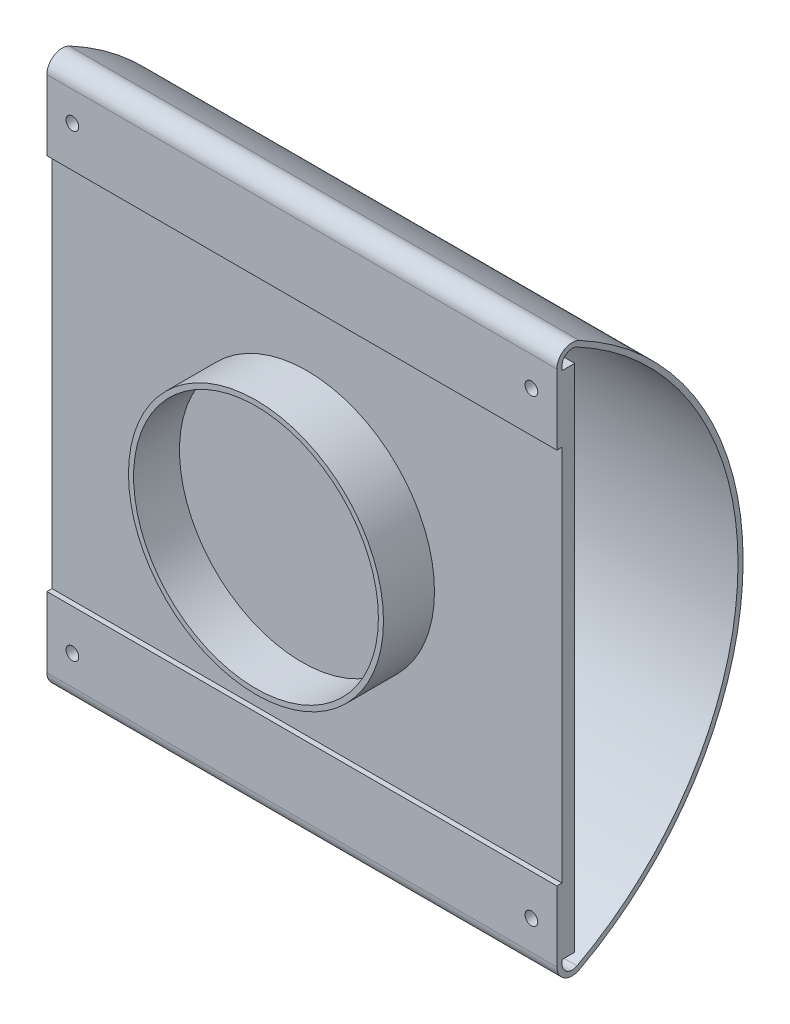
ISO-10303-21;
HEADER;
FILE_DESCRIPTION(('STEP AP214'),'2;1');
FILE_NAME('part.step','',(''),(''),'','','');
FILE_SCHEMA(('AUTOMOTIVE_DESIGN { 1 0 10303 214 1 1 1 1 }'));
ENDSEC;
DATA;
#1=APPLICATION_CONTEXT('core data for automotive mechanical design processes');
#2=APPLICATION_PROTOCOL_DEFINITION('international standard','automotive_design',2000,#1);
#3=PRODUCT_CONTEXT('',#1,'mechanical');
#4=PRODUCT('Part','Part','',(#3));
#5=PRODUCT_RELATED_PRODUCT_CATEGORY('part','',(#4));
#6=PRODUCT_DEFINITION_FORMATION('','',#4);
#7=PRODUCT_DEFINITION_CONTEXT('part definition',#1,'design');
#8=PRODUCT_DEFINITION('design','',#6,#7);
#9=PRODUCT_DEFINITION_SHAPE('','',#8);
#10=(LENGTH_UNIT() NAMED_UNIT(*) SI_UNIT(.MILLI.,.METRE.));
#11=(NAMED_UNIT(*) PLANE_ANGLE_UNIT() SI_UNIT($,.RADIAN.));
#12=(NAMED_UNIT(*) SI_UNIT($,.STERADIAN.) SOLID_ANGLE_UNIT());
#13=UNCERTAINTY_MEASURE_WITH_UNIT(LENGTH_MEASURE(1.E-05),#10,'distance_accuracy_value','');
#14=(GEOMETRIC_REPRESENTATION_CONTEXT(3) GLOBAL_UNCERTAINTY_ASSIGNED_CONTEXT((#13)) GLOBAL_UNIT_ASSIGNED_CONTEXT((#10,
#11,#12)) REPRESENTATION_CONTEXT('',''));
#15=CARTESIAN_POINT('',(0.,0.,0.));
#16=DIRECTION('',(0.,0.,1.));
#17=DIRECTION('',(1.,0.,0.));
#18=AXIS2_PLACEMENT_3D('',#15,#16,#17);
#19=CARTESIAN_POINT('',(-100.,-100.,5.));
#20=DIRECTION('',(0.,0.,-1.));
#21=DIRECTION('',(-1.,0.,0.));
#22=AXIS2_PLACEMENT_3D('',#19,#20,#21);
#23=PLANE('',#22);
#24=DIRECTION('',(0.,1.,0.));
#25=VECTOR('',#24,1.);
#26=CARTESIAN_POINT('',(-100.,-100.,5.));
#27=LINE('',#26,#25);
#28=CARTESIAN_POINT('',(-100.,-101.549200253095,5.00000000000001));
#29=VERTEX_POINT('',#28);
#30=CARTESIAN_POINT('',(-100.,-100.,5.));
#31=VERTEX_POINT('',#30);
#32=EDGE_CURVE('E213',#29,#31,#27,.T.);
#33=ORIENTED_EDGE('',*,*,#32,.T.);
#34=DIRECTION('',(1.,0.,0.));
#35=VECTOR('',#34,1.);
#36=CARTESIAN_POINT('',(-100.,-100.,5.));
#37=LINE('',#36,#35);
#38=CARTESIAN_POINT('',(100.,-100.,5.));
#39=VERTEX_POINT('',#38);
#40=EDGE_CURVE('E384',#31,#39,#37,.T.);
#41=ORIENTED_EDGE('',*,*,#40,.T.);
#42=DIRECTION('',(0.,1.,0.));
#43=VECTOR('',#42,1.);
#44=CARTESIAN_POINT('',(100.,-100.,5.));
#45=LINE('',#44,#43);
#46=CARTESIAN_POINT('',(100.,-101.549200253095,5.00000000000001));
#47=VERTEX_POINT('',#46);
#48=EDGE_CURVE('E310',#47,#39,#45,.T.);
#49=ORIENTED_EDGE('',*,*,#48,.F.);
#50=DIRECTION('',(1.,0.,0.));
#51=VECTOR('',#50,1.);
#52=CARTESIAN_POINT('',(-100.,-101.549200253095,5.00000000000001));
#53=LINE('',#52,#51);
#54=EDGE_CURVE('E259',#29,#47,#53,.T.);
#55=ORIENTED_EDGE('',*,*,#54,.F.);
#56=EDGE_LOOP('',(#33,#41,#49,#55));
#57=FACE_BOUND('',#56,.T.);
#58=ADVANCED_FACE('F50',(#57),#23,.T.);
#59=CARTESIAN_POINT('',(-100.,100.,5.));
#60=DIRECTION('',(0.,0.,-1.));
#61=DIRECTION('',(-1.,0.,0.));
#62=AXIS2_PLACEMENT_3D('',#59,#60,#61);
#63=PLANE('',#62);
#64=DIRECTION('',(0.,1.,0.));
#65=VECTOR('',#64,1.);
#66=CARTESIAN_POINT('',(100.,74.,5.));
#67=LINE('',#66,#65);
#68=CARTESIAN_POINT('',(100.,100.,5.));
#69=VERTEX_POINT('',#68);
#70=CARTESIAN_POINT('',(100.,101.549200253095,5.));
#71=VERTEX_POINT('',#70);
#72=EDGE_CURVE('E181',#69,#71,#67,.T.);
#73=ORIENTED_EDGE('',*,*,#72,.F.);
#74=DIRECTION('',(-1.,0.,0.));
#75=VECTOR('',#74,1.);
#76=CARTESIAN_POINT('',(-100.,100.,5.));
#77=LINE('',#76,#75);
#78=CARTESIAN_POINT('',(-100.,100.,5.));
#79=VERTEX_POINT('',#78);
#80=EDGE_CURVE('E167',#69,#79,#77,.T.);
#81=ORIENTED_EDGE('',*,*,#80,.T.);
#82=DIRECTION('',(0.,1.,0.));
#83=VECTOR('',#82,1.);
#84=CARTESIAN_POINT('',(-100.,74.,5.));
#85=LINE('',#84,#83);
#86=CARTESIAN_POINT('',(-100.,101.549200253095,5.));
#87=VERTEX_POINT('',#86);
#88=EDGE_CURVE('E179',#79,#87,#85,.T.);
#89=ORIENTED_EDGE('',*,*,#88,.T.);
#90=DIRECTION('',(1.,0.,0.));
#91=VECTOR('',#90,1.);
#92=CARTESIAN_POINT('',(-100.,101.549200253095,5.));
#93=LINE('',#92,#91);
#94=EDGE_CURVE('E267',#87,#71,#93,.T.);
#95=ORIENTED_EDGE('',*,*,#94,.T.);
#96=EDGE_LOOP('',(#73,#81,#89,#95));
#97=FACE_BOUND('',#96,.T.);
#98=ADVANCED_FACE('F177',(#97),#63,.T.);
#99=CARTESIAN_POINT('',(-100.,74.,7.));
#100=DIRECTION('',(0.,-1.,0.));
#101=DIRECTION('',(0.,0.,-1.));
#102=AXIS2_PLACEMENT_3D('',#99,#100,#101);
#103=PLANE('',#102);
#104=DIRECTION('',(1.,0.,0.));
#105=VECTOR('',#104,1.);
#106=CARTESIAN_POINT('',(-100.,74.,5.));
#107=LINE('',#106,#105);
#108=CARTESIAN_POINT('',(-100.,74.,5.));
#109=VERTEX_POINT('',#108);
#110=CARTESIAN_POINT('',(100.,74.,5.));
#111=VERTEX_POINT('',#110);
#112=EDGE_CURVE('E237',#109,#111,#107,.T.);
#113=ORIENTED_EDGE('',*,*,#112,.T.);
#114=DIRECTION('',(0.,0.,-1.));
#115=VECTOR('',#114,1.);
#116=CARTESIAN_POINT('',(100.,74.,7.));
#117=LINE('',#116,#115);
#118=CARTESIAN_POINT('',(100.,74.,7.));
#119=VERTEX_POINT('',#118);
#120=EDGE_CURVE('E275',#119,#111,#117,.T.);
#121=ORIENTED_EDGE('',*,*,#120,.F.);
#122=DIRECTION('',(1.,0.,0.));
#123=VECTOR('',#122,1.);
#124=CARTESIAN_POINT('',(-100.,74.,7.));
#125=LINE('',#124,#123);
#126=CARTESIAN_POINT('',(-100.,74.,7.));
#127=VERTEX_POINT('',#126);
#128=EDGE_CURVE('E59',#127,#119,#125,.T.);
#129=ORIENTED_EDGE('',*,*,#128,.F.);
#130=DIRECTION('',(0.,0.,-1.));
#131=VECTOR('',#130,1.);
#132=CARTESIAN_POINT('',(-100.,74.,7.));
#133=LINE('',#132,#131);
#134=EDGE_CURVE('E193',#127,#109,#133,.T.);
#135=ORIENTED_EDGE('',*,*,#134,.T.);
#136=EDGE_LOOP('',(#113,#121,#129,#135));
#137=FACE_BOUND('',#136,.T.);
#138=ADVANCED_FACE('F52',(#137),#103,.T.);
#139=CARTESIAN_POINT('',(-100.,74.,7.));
#140=DIRECTION('',(0.,0.,1.));
#141=DIRECTION('',(1.,0.,0.));
#142=AXIS2_PLACEMENT_3D('',#139,#140,#141);
#143=PLANE('',#142);
#144=CARTESIAN_POINT('',(90.,90.,7.));
#145=DIRECTION('',(0.,0.,1.));
#146=DIRECTION('',(-1.,0.,0.));
#147=AXIS2_PLACEMENT_3D('',#144,#145,#146);
#148=CIRCLE('',#147,2.50000000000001);
#149=CARTESIAN_POINT('',(87.5,90.,7.));
#150=VERTEX_POINT('',#149);
#151=EDGE_CURVE('E398',#150,#150,#148,.T.);
#152=ORIENTED_EDGE('',*,*,#151,.F.);
#153=EDGE_LOOP('',(#152));
#154=FACE_BOUND('',#153,.T.);
#155=CARTESIAN_POINT('',(-90.,89.9999999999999,7.));
#156=DIRECTION('',(0.,0.,1.));
#157=DIRECTION('',(1.,0.,0.));
#158=AXIS2_PLACEMENT_3D('',#155,#156,#157);
#159=CIRCLE('',#158,2.50000000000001);
#160=CARTESIAN_POINT('',(-87.5,89.9999999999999,7.));
#161=VERTEX_POINT('',#160);
#162=EDGE_CURVE('E347',#161,#161,#159,.T.);
#163=ORIENTED_EDGE('',*,*,#162,.F.);
#164=EDGE_LOOP('',(#163));
#165=FACE_BOUND('',#164,.T.);
#166=ORIENTED_EDGE('',*,*,#128,.T.);
#167=DIRECTION('',(0.,-1.,0.));
#168=VECTOR('',#167,1.);
#169=CARTESIAN_POINT('',(100.,100.,7.));
#170=LINE('',#169,#168);
#171=CARTESIAN_POINT('',(100.,101.549200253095,7.00000000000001));
#172=VERTEX_POINT('',#171);
#173=EDGE_CURVE('E202',#172,#119,#170,.T.);
#174=ORIENTED_EDGE('',*,*,#173,.F.);
#175=DIRECTION('',(1.,0.,0.));
#176=VECTOR('',#175,1.);
#177=CARTESIAN_POINT('',(-100.,101.549200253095,7.00000000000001));
#178=LINE('',#177,#176);
#179=CARTESIAN_POINT('',(-100.,101.549200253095,7.00000000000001));
#180=VERTEX_POINT('',#179);
#181=EDGE_CURVE('E240',#180,#172,#178,.T.);
#182=ORIENTED_EDGE('',*,*,#181,.F.);
#183=DIRECTION('',(0.,-1.,0.));
#184=VECTOR('',#183,1.);
#185=CARTESIAN_POINT('',(-100.,100.,7.));
#186=LINE('',#185,#184);
#187=EDGE_CURVE('E74',#180,#127,#186,.T.);
#188=ORIENTED_EDGE('',*,*,#187,.T.);
#189=EDGE_LOOP('',(#166,#174,#182,#188));
#190=FACE_BOUND('',#189,.T.);
#191=ADVANCED_FACE('F408',(#154,#165,#190),#143,.T.);
#192=CARTESIAN_POINT('',(-100.,101.549200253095,1.));
#193=DIRECTION('',(1.,0.,0.));
#194=DIRECTION('',(0.,0.,-1.));
#195=AXIS2_PLACEMENT_3D('',#192,#193,#194);
#196=CYLINDRICAL_SURFACE('',#195,6.00000000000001);
#197=ORIENTED_EDGE('',*,*,#181,.T.);
#198=CARTESIAN_POINT('',(100.,101.549200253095,1.));
#199=DIRECTION('',(1.,0.,0.));
#200=DIRECTION('',(0.,0.,1.));
#201=AXIS2_PLACEMENT_3D('',#198,#199,#200);
#202=CIRCLE('',#201,6.00000000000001);
#203=CARTESIAN_POINT('',(100.,106.847419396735,-1.81582561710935));
#204=VERTEX_POINT('',#203);
#205=EDGE_CURVE('E329',#204,#172,#202,.T.);
#206=ORIENTED_EDGE('',*,*,#205,.F.);
#207=DIRECTION('',(1.,0.,0.));
#208=VECTOR('',#207,1.);
#209=CARTESIAN_POINT('',(-100.,106.847419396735,-1.81582561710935));
#210=LINE('',#209,#208);
#211=CARTESIAN_POINT('',(-100.,106.847419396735,-1.81582561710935));
#212=VERTEX_POINT('',#211);
#213=EDGE_CURVE('E243',#212,#204,#210,.T.);
#214=ORIENTED_EDGE('',*,*,#213,.F.);
#215=CARTESIAN_POINT('',(-100.,101.549200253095,1.));
#216=DIRECTION('',(1.,0.,0.));
#217=DIRECTION('',(0.,0.,1.));
#218=AXIS2_PLACEMENT_3D('',#215,#216,#217);
#219=CIRCLE('',#218,6.00000000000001);
#220=EDGE_CURVE('E231',#212,#180,#219,.T.);
#221=ORIENTED_EDGE('',*,*,#220,.T.);
#222=EDGE_LOOP('',(#197,#206,#214,#221));
#223=FACE_BOUND('',#222,.T.);
#224=ADVANCED_FACE('F411',(#223),#196,.T.);
#225=CARTESIAN_POINT('',(-100.,0.,54.9699909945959));
#226=DIRECTION('',(1.,0.,0.));
#227=DIRECTION('',(0.,0.,-1.));
#228=AXIS2_PLACEMENT_3D('',#225,#226,#227);
#229=CYLINDRICAL_SURFACE('',#228,121.);
#230=ORIENTED_EDGE('',*,*,#213,.T.);
#231=CARTESIAN_POINT('',(100.,0.,54.9699909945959));
#232=DIRECTION('',(1.,0.,0.));
#233=DIRECTION('',(0.,0.,1.));
#234=AXIS2_PLACEMENT_3D('',#231,#232,#233);
#235=CIRCLE('',#234,121.);
#236=CARTESIAN_POINT('',(100.,-106.847419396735,-1.81582561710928));
#237=VERTEX_POINT('',#236);
#238=EDGE_CURVE('E325',#237,#204,#235,.T.);
#239=ORIENTED_EDGE('',*,*,#238,.F.);
#240=DIRECTION('',(1.,0.,0.));
#241=VECTOR('',#240,1.);
#242=CARTESIAN_POINT('',(-100.,-106.847419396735,-1.81582561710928));
#243=LINE('',#242,#241);
#244=CARTESIAN_POINT('',(-100.,-106.847419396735,-1.81582561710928));
#245=VERTEX_POINT('',#244);
#246=EDGE_CURVE('E246',#245,#237,#243,.T.);
#247=ORIENTED_EDGE('',*,*,#246,.F.);
#248=CARTESIAN_POINT('',(-100.,0.,54.9699909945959));
#249=DIRECTION('',(1.,0.,0.));
#250=DIRECTION('',(0.,0.,1.));
#251=AXIS2_PLACEMENT_3D('',#248,#249,#250);
#252=CIRCLE('',#251,121.);
#253=EDGE_CURVE('E228',#245,#212,#252,.T.);
#254=ORIENTED_EDGE('',*,*,#253,.T.);
#255=EDGE_LOOP('',(#230,#239,#247,#254));
#256=FACE_BOUND('',#255,.T.);
#257=ADVANCED_FACE('F432',(#256),#229,.T.);
#258=CARTESIAN_POINT('',(-100.,-101.549200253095,1.));
#259=DIRECTION('',(1.,0.,0.));
#260=DIRECTION('',(0.,0.,-1.));
#261=AXIS2_PLACEMENT_3D('',#258,#259,#260);
#262=CYLINDRICAL_SURFACE('',#261,6.00000000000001);
#263=ORIENTED_EDGE('',*,*,#246,.T.);
#264=CARTESIAN_POINT('',(100.,-101.549200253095,1.));
#265=DIRECTION('',(1.,0.,0.));
#266=DIRECTION('',(0.,0.,1.));
#267=AXIS2_PLACEMENT_3D('',#264,#265,#266);
#268=CIRCLE('',#267,6.00000000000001);
#269=CARTESIAN_POINT('',(100.,-101.549200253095,7.00000000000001));
#270=VERTEX_POINT('',#269);
#271=EDGE_CURVE('E321',#270,#237,#268,.T.);
#272=ORIENTED_EDGE('',*,*,#271,.F.);
#273=DIRECTION('',(1.,0.,0.));
#274=VECTOR('',#273,1.);
#275=CARTESIAN_POINT('',(-100.,-101.549200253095,7.00000000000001));
#276=LINE('',#275,#274);
#277=CARTESIAN_POINT('',(-100.,-101.549200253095,7.00000000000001));
#278=VERTEX_POINT('',#277);
#279=EDGE_CURVE('E249',#278,#270,#276,.T.);
#280=ORIENTED_EDGE('',*,*,#279,.F.);
#281=CARTESIAN_POINT('',(-100.,-101.549200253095,1.));
#282=DIRECTION('',(1.,0.,0.));
#283=DIRECTION('',(0.,0.,1.));
#284=AXIS2_PLACEMENT_3D('',#281,#282,#283);
#285=CIRCLE('',#284,6.00000000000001);
#286=EDGE_CURVE('E224',#278,#245,#285,.T.);
#287=ORIENTED_EDGE('',*,*,#286,.T.);
#288=EDGE_LOOP('',(#263,#272,#280,#287));
#289=FACE_BOUND('',#288,.T.);
#290=ADVANCED_FACE('F429',(#289),#262,.T.);
#291=CARTESIAN_POINT('',(-100.,-100.,7.));
#292=DIRECTION('',(0.,0.,1.));
#293=DIRECTION('',(0.,-1.,0.));
#294=AXIS2_PLACEMENT_3D('',#291,#292,#293);
#295=PLANE('',#294);
#296=CARTESIAN_POINT('',(-90.,-89.9999999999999,7.));
#297=DIRECTION('',(0.,0.,1.));
#298=DIRECTION('',(-1.,0.,0.));
#299=AXIS2_PLACEMENT_3D('',#296,#297,#298);
#300=CIRCLE('',#299,2.50000000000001);
#301=CARTESIAN_POINT('',(-92.5,-89.9999999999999,7.));
#302=VERTEX_POINT('',#301);
#303=EDGE_CURVE('E295',#302,#302,#300,.T.);
#304=ORIENTED_EDGE('',*,*,#303,.F.);
#305=EDGE_LOOP('',(#304));
#306=FACE_BOUND('',#305,.T.);
#307=CARTESIAN_POINT('',(90.,-90.,7.));
#308=DIRECTION('',(0.,0.,1.));
#309=DIRECTION('',(1.,0.,0.));
#310=AXIS2_PLACEMENT_3D('',#307,#308,#309);
#311=CIRCLE('',#310,2.50000000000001);
#312=CARTESIAN_POINT('',(92.5,-90.,7.));
#313=VERTEX_POINT('',#312);
#314=EDGE_CURVE('E286',#313,#313,#311,.T.);
#315=ORIENTED_EDGE('',*,*,#314,.F.);
#316=EDGE_LOOP('',(#315));
#317=FACE_BOUND('',#316,.T.);
#318=ORIENTED_EDGE('',*,*,#279,.T.);
#319=DIRECTION('',(0.,-1.,0.));
#320=VECTOR('',#319,1.);
#321=CARTESIAN_POINT('',(100.,-100.,7.));
#322=LINE('',#321,#320);
#323=CARTESIAN_POINT('',(100.,-74.,7.));
#324=VERTEX_POINT('',#323);
#325=EDGE_CURVE('E317',#324,#270,#322,.T.);
#326=ORIENTED_EDGE('',*,*,#325,.F.);
#327=DIRECTION('',(1.,0.,0.));
#328=VECTOR('',#327,1.);
#329=CARTESIAN_POINT('',(-100.,-74.,7.));
#330=LINE('',#329,#328);
#331=CARTESIAN_POINT('',(-100.,-74.,7.));
#332=VERTEX_POINT('',#331);
#333=EDGE_CURVE('E252',#332,#324,#330,.T.);
#334=ORIENTED_EDGE('',*,*,#333,.F.);
#335=DIRECTION('',(0.,-1.,0.));
#336=VECTOR('',#335,1.);
#337=CARTESIAN_POINT('',(-100.,-100.,7.));
#338=LINE('',#337,#336);
#339=EDGE_CURVE('E221',#332,#278,#338,.T.);
#340=ORIENTED_EDGE('',*,*,#339,.T.);
#341=EDGE_LOOP('',(#318,#326,#334,#340));
#342=FACE_BOUND('',#341,.T.);
#343=ADVANCED_FACE('F425',(#306,#317,#342),#295,.T.);
#344=CARTESIAN_POINT('',(-100.,-74.,7.));
#345=DIRECTION('',(0.,1.,0.));
#346=DIRECTION('',(0.,0.,1.));
#347=AXIS2_PLACEMENT_3D('',#344,#345,#346);
#348=PLANE('',#347);
#349=ORIENTED_EDGE('',*,*,#333,.T.);
#350=DIRECTION('',(0.,0.,1.));
#351=VECTOR('',#350,1.);
#352=CARTESIAN_POINT('',(100.,-74.,7.));
#353=LINE('',#352,#351);
#354=CARTESIAN_POINT('',(100.,-74.,5.));
#355=VERTEX_POINT('',#354);
#356=EDGE_CURVE('E314',#355,#324,#353,.T.);
#357=ORIENTED_EDGE('',*,*,#356,.F.);
#358=DIRECTION('',(1.,0.,0.));
#359=VECTOR('',#358,1.);
#360=CARTESIAN_POINT('',(-100.,-74.,5.));
#361=LINE('',#360,#359);
#362=CARTESIAN_POINT('',(-100.,-74.,5.));
#363=VERTEX_POINT('',#362);
#364=EDGE_CURVE('E255',#363,#355,#361,.T.);
#365=ORIENTED_EDGE('',*,*,#364,.F.);
#366=DIRECTION('',(0.,0.,1.));
#367=VECTOR('',#366,1.);
#368=CARTESIAN_POINT('',(-100.,-74.,7.));
#369=LINE('',#368,#367);
#370=EDGE_CURVE('E217',#363,#332,#369,.T.);
#371=ORIENTED_EDGE('',*,*,#370,.T.);
#372=EDGE_LOOP('',(#349,#357,#365,#371));
#373=FACE_BOUND('',#372,.T.);
#374=ADVANCED_FACE('F421',(#373),#348,.T.);
#375=CARTESIAN_POINT('',(-100.,-101.549200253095,1.));
#376=DIRECTION('',(1.,0.,0.));
#377=DIRECTION('',(0.,0.,-1.));
#378=AXIS2_PLACEMENT_3D('',#375,#376,#377);
#379=CYLINDRICAL_SURFACE('',#378,4.00000000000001);
#380=ORIENTED_EDGE('',*,*,#54,.T.);
#381=CARTESIAN_POINT('',(100.,-101.549200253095,1.));
#382=DIRECTION('',(-1.,0.,0.));
#383=DIRECTION('',(0.,0.,1.));
#384=AXIS2_PLACEMENT_3D('',#381,#382,#383);
#385=CIRCLE('',#384,4.00000000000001);
#386=CARTESIAN_POINT('',(100.,-105.081346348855,-0.877217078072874));
#387=VERTEX_POINT('',#386);
#388=EDGE_CURVE('E306',#387,#47,#385,.T.);
#389=ORIENTED_EDGE('',*,*,#388,.F.);
#390=DIRECTION('',(1.,0.,0.));
#391=VECTOR('',#390,1.);
#392=CARTESIAN_POINT('',(-100.,-105.081346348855,-0.877217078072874));
#393=LINE('',#392,#391);
#394=CARTESIAN_POINT('',(-100.,-105.081346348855,-0.877217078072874));
#395=VERTEX_POINT('',#394);
#396=EDGE_CURVE('E261',#395,#387,#393,.T.);
#397=ORIENTED_EDGE('',*,*,#396,.F.);
#398=CARTESIAN_POINT('',(-100.,-101.549200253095,1.));
#399=DIRECTION('',(-1.,0.,0.));
#400=DIRECTION('',(0.,0.,1.));
#401=AXIS2_PLACEMENT_3D('',#398,#399,#400);
#402=CIRCLE('',#401,4.00000000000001);
#403=EDGE_CURVE('E209',#395,#29,#402,.T.);
#404=ORIENTED_EDGE('',*,*,#403,.T.);
#405=EDGE_LOOP('',(#380,#389,#397,#404));
#406=FACE_BOUND('',#405,.T.);
#407=ADVANCED_FACE('F451',(#406),#379,.F.);
#408=CARTESIAN_POINT('',(-100.,0.,54.9699909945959));
#409=DIRECTION('',(1.,0.,0.));
#410=DIRECTION('',(0.,0.,-1.));
#411=AXIS2_PLACEMENT_3D('',#408,#409,#410);
#412=CYLINDRICAL_SURFACE('',#411,119.);
#413=ORIENTED_EDGE('',*,*,#396,.T.);
#414=CARTESIAN_POINT('',(100.,0.,54.9699909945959));
#415=DIRECTION('',(-1.,0.,0.));
#416=DIRECTION('',(0.,0.,1.));
#417=AXIS2_PLACEMENT_3D('',#414,#415,#416);
#418=CIRCLE('',#417,119.);
#419=CARTESIAN_POINT('',(100.,105.081346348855,-0.877217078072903));
#420=VERTEX_POINT('',#419);
#421=EDGE_CURVE('E302',#420,#387,#418,.T.);
#422=ORIENTED_EDGE('',*,*,#421,.F.);
#423=DIRECTION('',(1.,0.,0.));
#424=VECTOR('',#423,1.);
#425=CARTESIAN_POINT('',(-100.,105.081346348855,-0.877217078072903));
#426=LINE('',#425,#424);
#427=CARTESIAN_POINT('',(-100.,105.081346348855,-0.877217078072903));
#428=VERTEX_POINT('',#427);
#429=EDGE_CURVE('E264',#428,#420,#426,.T.);
#430=ORIENTED_EDGE('',*,*,#429,.F.);
#431=CARTESIAN_POINT('',(-100.,0.,54.9699909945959));
#432=DIRECTION('',(-1.,0.,0.));
#433=DIRECTION('',(0.,0.,1.));
#434=AXIS2_PLACEMENT_3D('',#431,#432,#433);
#435=CIRCLE('',#434,119.);
#436=EDGE_CURVE('E198',#428,#395,#435,.T.);
#437=ORIENTED_EDGE('',*,*,#436,.T.);
#438=EDGE_LOOP('',(#413,#422,#430,#437));
#439=FACE_BOUND('',#438,.T.);
#440=ADVANCED_FACE('F454',(#439),#412,.F.);
#441=CARTESIAN_POINT('',(-100.,101.549200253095,1.));
#442=DIRECTION('',(1.,0.,0.));
#443=DIRECTION('',(0.,0.,-1.));
#444=AXIS2_PLACEMENT_3D('',#441,#442,#443);
#445=CYLINDRICAL_SURFACE('',#444,4.00000000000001);
#446=ORIENTED_EDGE('',*,*,#429,.T.);
#447=CARTESIAN_POINT('',(100.,101.549200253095,1.));
#448=DIRECTION('',(-1.,0.,0.));
#449=DIRECTION('',(0.,0.,1.));
#450=AXIS2_PLACEMENT_3D('',#447,#448,#449);
#451=CIRCLE('',#450,4.00000000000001);
#452=EDGE_CURVE('E291',#71,#420,#451,.T.);
#453=ORIENTED_EDGE('',*,*,#452,.F.);
#454=ORIENTED_EDGE('',*,*,#94,.F.);
#455=CARTESIAN_POINT('',(-100.,101.549200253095,1.));
#456=DIRECTION('',(-1.,0.,0.));
#457=DIRECTION('',(0.,0.,1.));
#458=AXIS2_PLACEMENT_3D('',#455,#456,#457);
#459=CIRCLE('',#458,4.00000000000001);
#460=EDGE_CURVE('E191',#87,#428,#459,.T.);
#461=ORIENTED_EDGE('',*,*,#460,.T.);
#462=EDGE_LOOP('',(#446,#453,#454,#461));
#463=FACE_BOUND('',#462,.T.);
#464=ADVANCED_FACE('F458',(#463),#445,.F.);
#465=CARTESIAN_POINT('',(-100.,101.549200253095,1.));
#466=DIRECTION('',(-1.,0.,0.));
#467=DIRECTION('',(0.,0.,1.));
#468=AXIS2_PLACEMENT_3D('',#465,#466,#467);
#469=PLANE('',#468);
#470=ORIENTED_EDGE('',*,*,#88,.F.);
#471=DIRECTION('',(0.,0.,-1.));
#472=VECTOR('',#471,1.);
#473=CARTESIAN_POINT('',(-100.,100.,5.));
#474=LINE('',#473,#472);
#475=CARTESIAN_POINT('',(-100.,100.,0.));
#476=VERTEX_POINT('',#475);
#477=EDGE_CURVE('E164',#79,#476,#474,.T.);
#478=ORIENTED_EDGE('',*,*,#477,.T.);
#479=DIRECTION('',(0.,-1.,0.));
#480=VECTOR('',#479,1.);
#481=CARTESIAN_POINT('',(-100.,-100.,0.));
#482=LINE('',#481,#480);
#483=CARTESIAN_POINT('',(-100.,-100.,0.));
#484=VERTEX_POINT('',#483);
#485=EDGE_CURVE('E335',#476,#484,#482,.T.);
#486=ORIENTED_EDGE('',*,*,#485,.T.);
#487=DIRECTION('',(0.,0.,-1.));
#488=VECTOR('',#487,1.);
#489=CARTESIAN_POINT('',(-100.,-100.,5.));
#490=LINE('',#489,#488);
#491=EDGE_CURVE('E174',#31,#484,#490,.T.);
#492=ORIENTED_EDGE('',*,*,#491,.F.);
#493=ORIENTED_EDGE('',*,*,#32,.F.);
#494=ORIENTED_EDGE('',*,*,#403,.F.);
#495=ORIENTED_EDGE('',*,*,#436,.F.);
#496=ORIENTED_EDGE('',*,*,#460,.F.);
#497=EDGE_LOOP('',(#470,#478,#486,#492,#493,#494,#495,#496));
#498=FACE_BOUND('',#497,.T.);
#499=ORIENTED_EDGE('',*,*,#134,.F.);
#500=ORIENTED_EDGE('',*,*,#187,.F.);
#501=ORIENTED_EDGE('',*,*,#220,.F.);
#502=ORIENTED_EDGE('',*,*,#253,.F.);
#503=ORIENTED_EDGE('',*,*,#286,.F.);
#504=ORIENTED_EDGE('',*,*,#339,.F.);
#505=ORIENTED_EDGE('',*,*,#370,.F.);
#506=DIRECTION('',(0.,-1.,0.));
#507=VECTOR('',#506,1.);
#508=CARTESIAN_POINT('',(-100.,-100.,5.));
#509=LINE('',#508,#507);
#510=EDGE_CURVE('E183',#109,#363,#509,.T.);
#511=ORIENTED_EDGE('',*,*,#510,.F.);
#512=EDGE_LOOP('',(#499,#500,#501,#502,#503,#504,#505,#511));
#513=FACE_BOUND('',#512,.T.);
#514=ADVANCED_FACE('F187',(#498,#513),#469,.T.);
#515=CARTESIAN_POINT('',(100.,101.549200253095,1.));
#516=DIRECTION('',(-1.,0.,0.));
#517=DIRECTION('',(0.,0.,1.));
#518=AXIS2_PLACEMENT_3D('',#515,#516,#517);
#519=PLANE('',#518);
#520=DIRECTION('',(0.,0.,-1.));
#521=VECTOR('',#520,1.);
#522=CARTESIAN_POINT('',(100.,100.,5.));
#523=LINE('',#522,#521);
#524=CARTESIAN_POINT('',(100.,100.,0.));
#525=VERTEX_POINT('',#524);
#526=EDGE_CURVE('E66',#69,#525,#523,.T.);
#527=ORIENTED_EDGE('',*,*,#526,.F.);
#528=ORIENTED_EDGE('',*,*,#72,.T.);
#529=ORIENTED_EDGE('',*,*,#452,.T.);
#530=ORIENTED_EDGE('',*,*,#421,.T.);
#531=ORIENTED_EDGE('',*,*,#388,.T.);
#532=ORIENTED_EDGE('',*,*,#48,.T.);
#533=DIRECTION('',(0.,0.,-1.));
#534=VECTOR('',#533,1.);
#535=CARTESIAN_POINT('',(100.,-100.,5.));
#536=LINE('',#535,#534);
#537=CARTESIAN_POINT('',(100.,-100.,0.));
#538=VERTEX_POINT('',#537);
#539=EDGE_CURVE('E339',#39,#538,#536,.T.);
#540=ORIENTED_EDGE('',*,*,#539,.T.);
#541=DIRECTION('',(0.,1.,0.));
#542=VECTOR('',#541,1.);
#543=CARTESIAN_POINT('',(100.,-100.,0.));
#544=LINE('',#543,#542);
#545=EDGE_CURVE('E336',#538,#525,#544,.T.);
#546=ORIENTED_EDGE('',*,*,#545,.T.);
#547=EDGE_LOOP('',(#527,#528,#529,#530,#531,#532,#540,#546));
#548=FACE_BOUND('',#547,.T.);
#549=ORIENTED_EDGE('',*,*,#120,.T.);
#550=DIRECTION('',(0.,1.,0.));
#551=VECTOR('',#550,1.);
#552=CARTESIAN_POINT('',(100.,-100.,5.));
#553=LINE('',#552,#551);
#554=EDGE_CURVE('E184',#355,#111,#553,.T.);
#555=ORIENTED_EDGE('',*,*,#554,.F.);
#556=ORIENTED_EDGE('',*,*,#356,.T.);
#557=ORIENTED_EDGE('',*,*,#325,.T.);
#558=ORIENTED_EDGE('',*,*,#271,.T.);
#559=ORIENTED_EDGE('',*,*,#238,.T.);
#560=ORIENTED_EDGE('',*,*,#205,.T.);
#561=ORIENTED_EDGE('',*,*,#173,.T.);
#562=EDGE_LOOP('',(#549,#555,#556,#557,#558,#559,#560,#561));
#563=FACE_BOUND('',#562,.T.);
#564=ADVANCED_FACE('F281',(#548,#563),#519,.F.);
#565=CARTESIAN_POINT('',(-90.,89.9999999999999,2.));
#566=DIRECTION('',(0.,0.,1.));
#567=DIRECTION('',(1.,0.,0.));
#568=AXIS2_PLACEMENT_3D('',#565,#566,#567);
#569=CYLINDRICAL_SURFACE('',#568,2.50000000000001);
#570=ORIENTED_EDGE('',*,*,#162,.T.);
#571=EDGE_LOOP('',(#570));
#572=FACE_BOUND('',#571,.T.);
#573=CARTESIAN_POINT('',(-90.,90.,0.));
#574=DIRECTION('',(0.,0.,1.));
#575=DIRECTION('',(1.,0.,0.));
#576=AXIS2_PLACEMENT_3D('',#573,#574,#575);
#577=CIRCLE('',#576,2.50000000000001);
#578=CARTESIAN_POINT('',(-87.5,90.,0.));
#579=VERTEX_POINT('',#578);
#580=EDGE_CURVE('E342',#579,#579,#577,.T.);
#581=ORIENTED_EDGE('',*,*,#580,.F.);
#582=EDGE_LOOP('',(#581));
#583=FACE_BOUND('',#582,.T.);
#584=ADVANCED_FACE('F491',(#572,#583),#569,.F.);
#585=CARTESIAN_POINT('',(90.,90.,2.));
#586=DIRECTION('',(0.,0.,1.));
#587=DIRECTION('',(1.,0.,0.));
#588=AXIS2_PLACEMENT_3D('',#585,#586,#587);
#589=CYLINDRICAL_SURFACE('',#588,2.50000000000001);
#590=ORIENTED_EDGE('',*,*,#151,.T.);
#591=EDGE_LOOP('',(#590));
#592=FACE_BOUND('',#591,.T.);
#593=CARTESIAN_POINT('',(90.,90.,0.));
#594=DIRECTION('',(0.,0.,1.));
#595=DIRECTION('',(1.,0.,0.));
#596=AXIS2_PLACEMENT_3D('',#593,#594,#595);
#597=CIRCLE('',#596,2.50000000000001);
#598=CARTESIAN_POINT('',(92.5,90.,0.));
#599=VERTEX_POINT('',#598);
#600=EDGE_CURVE('E345',#599,#599,#597,.T.);
#601=ORIENTED_EDGE('',*,*,#600,.F.);
#602=EDGE_LOOP('',(#601));
#603=FACE_BOUND('',#602,.T.);
#604=ADVANCED_FACE('F405',(#592,#603),#589,.F.);
#605=CARTESIAN_POINT('',(90.,-90.,2.));
#606=DIRECTION('',(0.,0.,1.));
#607=DIRECTION('',(1.,0.,0.));
#608=AXIS2_PLACEMENT_3D('',#605,#606,#607);
#609=CYLINDRICAL_SURFACE('',#608,2.50000000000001);
#610=ORIENTED_EDGE('',*,*,#314,.T.);
#611=EDGE_LOOP('',(#610));
#612=FACE_BOUND('',#611,.T.);
#613=CARTESIAN_POINT('',(90.,-90.,0.));
#614=DIRECTION('',(0.,0.,1.));
#615=DIRECTION('',(1.,0.,0.));
#616=AXIS2_PLACEMENT_3D('',#613,#614,#615);
#617=CIRCLE('',#616,2.50000000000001);
#618=CARTESIAN_POINT('',(92.5,-90.,0.));
#619=VERTEX_POINT('',#618);
#620=EDGE_CURVE('E352',#619,#619,#617,.T.);
#621=ORIENTED_EDGE('',*,*,#620,.F.);
#622=EDGE_LOOP('',(#621));
#623=FACE_BOUND('',#622,.T.);
#624=ADVANCED_FACE('F497',(#612,#623),#609,.F.);
#625=CARTESIAN_POINT('',(-90.,-89.9999999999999,2.));
#626=DIRECTION('',(0.,0.,1.));
#627=DIRECTION('',(1.,0.,0.));
#628=AXIS2_PLACEMENT_3D('',#625,#626,#627);
#629=CYLINDRICAL_SURFACE('',#628,2.50000000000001);
#630=ORIENTED_EDGE('',*,*,#303,.T.);
#631=EDGE_LOOP('',(#630));
#632=FACE_BOUND('',#631,.T.);
#633=CARTESIAN_POINT('',(-90.,-90.,0.));
#634=DIRECTION('',(0.,0.,1.));
#635=DIRECTION('',(1.,0.,0.));
#636=AXIS2_PLACEMENT_3D('',#633,#634,#635);
#637=CIRCLE('',#636,2.50000000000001);
#638=CARTESIAN_POINT('',(-87.5,-90.,0.));
#639=VERTEX_POINT('',#638);
#640=EDGE_CURVE('E350',#639,#639,#637,.T.);
#641=ORIENTED_EDGE('',*,*,#640,.F.);
#642=EDGE_LOOP('',(#641));
#643=FACE_BOUND('',#642,.T.);
#644=ADVANCED_FACE('F487',(#632,#643),#629,.F.);
#645=CARTESIAN_POINT('',(-100.,100.,5.));
#646=DIRECTION('',(0.,-1.,0.));
#647=DIRECTION('',(0.,0.,-1.));
#648=AXIS2_PLACEMENT_3D('',#645,#646,#647);
#649=PLANE('',#648);
#650=DIRECTION('',(-1.,0.,0.));
#651=VECTOR('',#650,1.);
#652=CARTESIAN_POINT('',(-100.,100.,0.));
#653=LINE('',#652,#651);
#654=EDGE_CURVE('E169',#525,#476,#653,.T.);
#655=ORIENTED_EDGE('',*,*,#654,.T.);
#656=ORIENTED_EDGE('',*,*,#477,.F.);
#657=ORIENTED_EDGE('',*,*,#80,.F.);
#658=ORIENTED_EDGE('',*,*,#526,.T.);
#659=EDGE_LOOP('',(#655,#656,#657,#658));
#660=FACE_BOUND('',#659,.T.);
#661=ADVANCED_FACE('F166',(#660),#649,.F.);
#662=CARTESIAN_POINT('',(-100.,-100.,5.));
#663=DIRECTION('',(0.,1.,0.));
#664=DIRECTION('',(0.,0.,1.));
#665=AXIS2_PLACEMENT_3D('',#662,#663,#664);
#666=PLANE('',#665);
#667=DIRECTION('',(1.,0.,0.));
#668=VECTOR('',#667,1.);
#669=CARTESIAN_POINT('',(-100.,-100.,0.));
#670=LINE('',#669,#668);
#671=EDGE_CURVE('E380',#484,#538,#670,.T.);
#672=ORIENTED_EDGE('',*,*,#671,.T.);
#673=ORIENTED_EDGE('',*,*,#539,.F.);
#674=ORIENTED_EDGE('',*,*,#40,.F.);
#675=ORIENTED_EDGE('',*,*,#491,.T.);
#676=EDGE_LOOP('',(#672,#673,#674,#675));
#677=FACE_BOUND('',#676,.T.);
#678=ADVANCED_FACE('F478',(#677),#666,.F.);
#679=CARTESIAN_POINT('',(0.,0.,5.));
#680=DIRECTION('',(0.,0.,-1.));
#681=DIRECTION('',(-1.,0.,0.));
#682=AXIS2_PLACEMENT_3D('',#679,#680,#681);
#683=PLANE('',#682);
#684=CARTESIAN_POINT('',(0.,0.,5.));
#685=DIRECTION('',(0.,0.,-1.));
#686=DIRECTION('',(-1.,0.,0.));
#687=AXIS2_PLACEMENT_3D('',#684,#685,#686);
#688=CIRCLE('',#687,50.);
#689=CARTESIAN_POINT('',(-50.,0.,5.));
#690=VERTEX_POINT('',#689);
#691=EDGE_CURVE('E12',#690,#690,#688,.F.);
#692=ORIENTED_EDGE('',*,*,#691,.F.);
#693=EDGE_LOOP('',(#692));
#694=FACE_BOUND('',#693,.T.);
#695=ORIENTED_EDGE('',*,*,#112,.F.);
#696=ORIENTED_EDGE('',*,*,#510,.T.);
#697=ORIENTED_EDGE('',*,*,#364,.T.);
#698=ORIENTED_EDGE('',*,*,#554,.T.);
#699=EDGE_LOOP('',(#695,#696,#697,#698));
#700=FACE_BOUND('',#699,.T.);
#701=ADVANCED_FACE('F418',(#694,#700),#683,.F.);
#702=CARTESIAN_POINT('',(0.,0.,0.));
#703=DIRECTION('',(0.,0.,-1.));
#704=DIRECTION('',(-1.,0.,0.));
#705=AXIS2_PLACEMENT_3D('',#702,#703,#704);
#706=PLANE('',#705);
#707=CARTESIAN_POINT('',(0.,0.,0.));
#708=DIRECTION('',(0.,0.,-1.));
#709=DIRECTION('',(-1.,0.,0.));
#710=AXIS2_PLACEMENT_3D('',#707,#708,#709);
#711=CIRCLE('',#710,30.);
#712=CARTESIAN_POINT('',(-30.,0.,0.));
#713=VERTEX_POINT('',#712);
#714=EDGE_CURVE('E357',#713,#713,#711,.T.);
#715=ORIENTED_EDGE('',*,*,#714,.F.);
#716=EDGE_LOOP('',(#715));
#717=FACE_BOUND('',#716,.T.);
#718=ORIENTED_EDGE('',*,*,#600,.T.);
#719=EDGE_LOOP('',(#718));
#720=FACE_BOUND('',#719,.T.);
#721=ORIENTED_EDGE('',*,*,#640,.T.);
#722=EDGE_LOOP('',(#721));
#723=FACE_BOUND('',#722,.T.);
#724=ORIENTED_EDGE('',*,*,#620,.T.);
#725=EDGE_LOOP('',(#724));
#726=FACE_BOUND('',#725,.T.);
#727=ORIENTED_EDGE('',*,*,#580,.T.);
#728=EDGE_LOOP('',(#727));
#729=FACE_BOUND('',#728,.T.);
#730=ORIENTED_EDGE('',*,*,#545,.F.);
#731=ORIENTED_EDGE('',*,*,#671,.F.);
#732=ORIENTED_EDGE('',*,*,#485,.F.);
#733=ORIENTED_EDGE('',*,*,#654,.F.);
#734=EDGE_LOOP('',(#730,#731,#732,#733));
#735=FACE_BOUND('',#734,.T.);
#736=ADVANCED_FACE('F477',(#717,#720,#723,#726,#729,#735),#706,.T.);
#737=CARTESIAN_POINT('',(0.,0.,-10.));
#738=DIRECTION('',(0.,0.,1.));
#739=DIRECTION('',(1.,0.,0.));
#740=AXIS2_PLACEMENT_3D('',#737,#738,#739);
#741=CYLINDRICAL_SURFACE('',#740,30.);
#742=CARTESIAN_POINT('',(0.,0.,-10.));
#743=DIRECTION('',(0.,0.,-1.));
#744=DIRECTION('',(-1.,0.,0.));
#745=AXIS2_PLACEMENT_3D('',#742,#743,#744);
#746=CIRCLE('',#745,30.);
#747=CARTESIAN_POINT('',(-30.,0.,-10.));
#748=VERTEX_POINT('',#747);
#749=EDGE_CURVE('E364',#748,#748,#746,.T.);
#750=ORIENTED_EDGE('',*,*,#749,.F.);
#751=EDGE_LOOP('',(#750));
#752=FACE_BOUND('',#751,.T.);
#753=ORIENTED_EDGE('',*,*,#714,.T.);
#754=EDGE_LOOP('',(#753));
#755=FACE_BOUND('',#754,.T.);
#756=ADVANCED_FACE('F539',(#752,#755),#741,.T.);
#757=CARTESIAN_POINT('',(0.,0.,-10.));
#758=DIRECTION('',(0.,0.,-1.));
#759=DIRECTION('',(-1.,0.,0.));
#760=AXIS2_PLACEMENT_3D('',#757,#758,#759);
#761=PLANE('',#760);
#762=ORIENTED_EDGE('',*,*,#749,.T.);
#763=EDGE_LOOP('',(#762));
#764=FACE_BOUND('',#763,.T.);
#765=ADVANCED_FACE('F547',(#764),#761,.T.);
#766=CARTESIAN_POINT('',(0.,0.,25.));
#767=DIRECTION('',(0.,0.,-1.));
#768=DIRECTION('',(-1.,0.,0.));
#769=AXIS2_PLACEMENT_3D('',#766,#767,#768);
#770=CYLINDRICAL_SURFACE('',#769,50.);
#771=CARTESIAN_POINT('',(0.,0.,25.));
#772=DIRECTION('',(0.,0.,1.));
#773=DIRECTION('',(1.,0.,0.));
#774=AXIS2_PLACEMENT_3D('',#771,#772,#773);
#775=CIRCLE('',#774,50.);
#776=CARTESIAN_POINT('',(50.,0.,25.));
#777=VERTEX_POINT('',#776);
#778=EDGE_CURVE('E355',#777,#777,#775,.T.);
#779=ORIENTED_EDGE('',*,*,#778,.F.);
#780=EDGE_LOOP('',(#779));
#781=FACE_BOUND('',#780,.T.);
#782=ORIENTED_EDGE('',*,*,#691,.T.);
#783=EDGE_LOOP('',(#782));
#784=FACE_BOUND('',#783,.T.);
#785=ADVANCED_FACE('F556',(#781,#784),#770,.T.);
#786=CARTESIAN_POINT('',(0.,0.,25.));
#787=DIRECTION('',(0.,0.,1.));
#788=DIRECTION('',(1.,0.,0.));
#789=AXIS2_PLACEMENT_3D('',#786,#787,#788);
#790=PLANE('',#789);
#791=CARTESIAN_POINT('',(0.,0.,25.));
#792=DIRECTION('',(0.,0.,1.));
#793=DIRECTION('',(1.,0.,0.));
#794=AXIS2_PLACEMENT_3D('',#791,#792,#793);
#795=CIRCLE('',#794,48.);
#796=CARTESIAN_POINT('',(48.,0.,25.));
#797=VERTEX_POINT('',#796);
#798=EDGE_CURVE('E367',#797,#797,#795,.T.);
#799=ORIENTED_EDGE('',*,*,#798,.F.);
#800=EDGE_LOOP('',(#799));
#801=FACE_BOUND('',#800,.T.);
#802=ORIENTED_EDGE('',*,*,#778,.T.);
#803=EDGE_LOOP('',(#802));
#804=FACE_BOUND('',#803,.T.);
#805=ADVANCED_FACE('F565',(#801,#804),#790,.T.);
#806=CARTESIAN_POINT('',(0.,0.,7.));
#807=DIRECTION('',(0.,0.,1.));
#808=DIRECTION('',(1.,0.,0.));
#809=AXIS2_PLACEMENT_3D('',#806,#807,#808);
#810=CYLINDRICAL_SURFACE('',#809,48.);
#811=CARTESIAN_POINT('',(0.,0.,7.));
#812=DIRECTION('',(0.,0.,1.));
#813=DIRECTION('',(1.,0.,0.));
#814=AXIS2_PLACEMENT_3D('',#811,#812,#813);
#815=CIRCLE('',#814,48.);
#816=CARTESIAN_POINT('',(48.,0.,7.));
#817=VERTEX_POINT('',#816);
#818=EDGE_CURVE('E358',#817,#817,#815,.T.);
#819=ORIENTED_EDGE('',*,*,#818,.F.);
#820=EDGE_LOOP('',(#819));
#821=FACE_BOUND('',#820,.T.);
#822=ORIENTED_EDGE('',*,*,#798,.T.);
#823=EDGE_LOOP('',(#822));
#824=FACE_BOUND('',#823,.T.);
#825=ADVANCED_FACE('F574',(#821,#824),#810,.F.);
#826=CARTESIAN_POINT('',(0.,0.,7.));
#827=DIRECTION('',(0.,0.,1.));
#828=DIRECTION('',(1.,0.,0.));
#829=AXIS2_PLACEMENT_3D('',#826,#827,#828);
#830=PLANE('',#829);
#831=ORIENTED_EDGE('',*,*,#818,.T.);
#832=EDGE_LOOP('',(#831));
#833=FACE_BOUND('',#832,.T.);
#834=ADVANCED_FACE('F583',(#833),#830,.T.);
#835=CLOSED_SHELL('',(#58,#98,#138,#191,#224,#257,#290,#343,#374,#407,#440,#464,#514,#564,#584,
#604,#624,#644,#661,#678,#701,#736,#756,#765,#785,#805,#825,#834));
#836=MANIFOLD_SOLID_BREP('B2',#835);
#837=CARTESIAN_POINT('',(0.,0.,-10.));
#838=DIRECTION('',(0.,-1.,0.));
#839=DIRECTION('',(1.,0.,0.));
#840=AXIS2_PLACEMENT_3D('',#837,#838,#839);
#841=SPHERICAL_SURFACE('',#840,25.);
#842=CARTESIAN_POINT('',(0.,0.,-10.));
#843=DIRECTION('',(0.,0.,-1.));
#844=DIRECTION('',(1.,0.,0.));
#845=AXIS2_PLACEMENT_3D('',#842,#843,#844);
#846=SPHERICAL_SURFACE('',#845,25.);
#847=CARTESIAN_POINT('',(0.,0.,-10.));
#848=DIRECTION('',(0.,0.,-1.));
#849=DIRECTION('',(1.,0.,0.));
#850=AXIS2_PLACEMENT_3D('',#847,#848,#849);
#851=CIRCLE('',#850,25.);
#852=CARTESIAN_POINT('',(25.,0.,-10.0000000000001));
#853=VERTEX_POINT('',#852);
#854=EDGE_CURVE('E49',#853,#853,#851,.T.);
#855=ORIENTED_EDGE('',*,*,#854,.T.);
#856=EDGE_LOOP('',(#855));
#857=FACE_BOUND('',#856,.T.);
#858=ADVANCED_FACE('F837',(#857),#846,.T.);
#859=CARTESIAN_POINT('',(0.,0.,-10.));
#860=DIRECTION('',(0.,0.,1.));
#861=DIRECTION('',(1.,0.,0.));
#862=AXIS2_PLACEMENT_3D('',#859,#860,#861);
#863=PLANE('',#862);
#864=ORIENTED_EDGE('',*,*,#854,.F.);
#865=EDGE_LOOP('',(#864));
#866=FACE_BOUND('',#865,.T.);
#867=ADVANCED_FACE('F846',(#866),#863,.T.);
#868=CLOSED_SHELL('',(#858,#867));
#869=MANIFOLD_SOLID_BREP('B6',#868);
#870=ADVANCED_BREP_SHAPE_REPRESENTATION('',(#18,#836,#869),#14);
#871=SHAPE_DEFINITION_REPRESENTATION(#9,#870);
ENDSEC;
END-ISO-10303-21;
